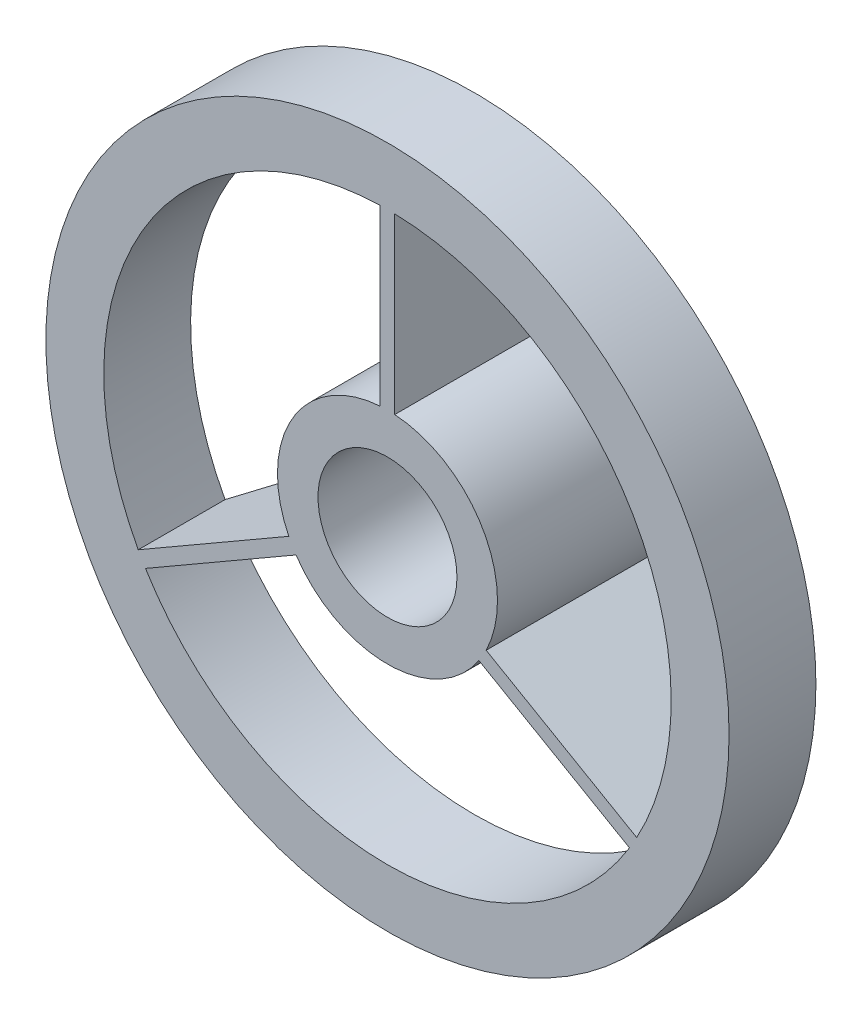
ISO-10303-21;
HEADER;
FILE_DESCRIPTION(('STEP AP214'),'2;1');
FILE_NAME('part.step','',(''),(''),'','','');
FILE_SCHEMA(('AUTOMOTIVE_DESIGN { 1 0 10303 214 1 1 1 1 }'));
ENDSEC;
DATA;
#1=APPLICATION_CONTEXT('core data for automotive mechanical design processes');
#2=APPLICATION_PROTOCOL_DEFINITION('international standard','automotive_design',2000,#1);
#3=PRODUCT_CONTEXT('',#1,'mechanical');
#4=PRODUCT('Part','Part','',(#3));
#5=PRODUCT_RELATED_PRODUCT_CATEGORY('part','',(#4));
#6=PRODUCT_DEFINITION_FORMATION('','',#4);
#7=PRODUCT_DEFINITION_CONTEXT('part definition',#1,'design');
#8=PRODUCT_DEFINITION('design','',#6,#7);
#9=PRODUCT_DEFINITION_SHAPE('','',#8);
#10=(LENGTH_UNIT() NAMED_UNIT(*) SI_UNIT(.MILLI.,.METRE.));
#11=(NAMED_UNIT(*) PLANE_ANGLE_UNIT() SI_UNIT($,.RADIAN.));
#12=(NAMED_UNIT(*) SI_UNIT($,.STERADIAN.) SOLID_ANGLE_UNIT());
#13=UNCERTAINTY_MEASURE_WITH_UNIT(LENGTH_MEASURE(1.E-05),#10,'distance_accuracy_value','');
#14=(GEOMETRIC_REPRESENTATION_CONTEXT(3) GLOBAL_UNCERTAINTY_ASSIGNED_CONTEXT((#13)) GLOBAL_UNIT_ASSIGNED_CONTEXT((#10,
#11,#12)) REPRESENTATION_CONTEXT('',''));
#15=CARTESIAN_POINT('',(0.,0.,0.));
#16=DIRECTION('',(0.,0.,1.));
#17=DIRECTION('',(1.,0.,0.));
#18=AXIS2_PLACEMENT_3D('',#15,#16,#17);
#19=CARTESIAN_POINT('',(0.,0.,3.5));
#20=DIRECTION('',(0.,0.,-1.));
#21=DIRECTION('',(-1.,0.,0.));
#22=AXIS2_PLACEMENT_3D('',#19,#20,#21);
#23=CYLINDRICAL_SURFACE('',#22,1.9);
#24=DIRECTION('',(0.,0.,-1.));
#25=VECTOR('',#24,1.);
#26=CARTESIAN_POINT('',(-1.70438344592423,-0.839688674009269,3.5));
#27=LINE('',#26,#25);
#28=CARTESIAN_POINT('',(-1.70438344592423,-0.83968867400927,3.5));
#29=VERTEX_POINT('',#28);
#30=CARTESIAN_POINT('',(-1.70438344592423,-0.83968867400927,0.));
#31=VERTEX_POINT('',#30);
#32=EDGE_CURVE('E168',#29,#31,#27,.T.);
#33=ORIENTED_EDGE('',*,*,#32,.F.);
#34=CARTESIAN_POINT('',(0.,0.,3.5));
#35=DIRECTION('',(0.,0.,1.));
#36=DIRECTION('',(1.,0.,0.));
#37=AXIS2_PLACEMENT_3D('',#34,#35,#36);
#38=CIRCLE('',#37,1.9);
#39=CARTESIAN_POINT('',(-0.125,1.89588369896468,3.5));
#40=VERTEX_POINT('',#39);
#41=EDGE_CURVE('E289',#40,#29,#38,.T.);
#42=ORIENTED_EDGE('',*,*,#41,.F.);
#43=DIRECTION('',(0.,0.,-1.));
#44=VECTOR('',#43,1.);
#45=CARTESIAN_POINT('',(-0.125,1.89588369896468,3.5));
#46=LINE('',#45,#44);
#47=CARTESIAN_POINT('',(-0.125,1.89588369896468,0.));
#48=VERTEX_POINT('',#47);
#49=EDGE_CURVE('E292',#40,#48,#46,.T.);
#50=ORIENTED_EDGE('',*,*,#49,.T.);
#51=CARTESIAN_POINT('',(0.,0.,0.));
#52=DIRECTION('',(0.,0.,1.));
#53=DIRECTION('',(1.,0.,0.));
#54=AXIS2_PLACEMENT_3D('',#51,#52,#53);
#55=CIRCLE('',#54,1.9);
#56=EDGE_CURVE('E295',#48,#31,#55,.T.);
#57=ORIENTED_EDGE('',*,*,#56,.T.);
#58=EDGE_LOOP('',(#33,#42,#50,#57));
#59=FACE_BOUND('',#58,.T.);
#60=ADVANCED_FACE('F37',(#59),#23,.T.);
#61=CARTESIAN_POINT('',(0.,0.,2.));
#62=DIRECTION('',(0.,0.,1.));
#63=DIRECTION('',(1.,0.,0.));
#64=AXIS2_PLACEMENT_3D('',#61,#62,#63);
#65=PLANE('',#64);
#66=CARTESIAN_POINT('',(0.,0.,2.));
#67=DIRECTION('',(0.,0.,1.));
#68=DIRECTION('',(1.,0.,0.));
#69=AXIS2_PLACEMENT_3D('',#66,#67,#68);
#70=CIRCLE('',#69,5.9);
#71=CARTESIAN_POINT('',(5.9,0.,2.));
#72=VERTEX_POINT('',#71);
#73=EDGE_CURVE('E246',#72,#72,#70,.T.);
#74=ORIENTED_EDGE('',*,*,#73,.F.);
#75=EDGE_LOOP('',(#74));
#76=FACE_BOUND('',#75,.T.);
#77=DIRECTION('',(0.866025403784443,0.499999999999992,0.));
#78=VECTOR('',#77,1.);
#79=CARTESIAN_POINT('',(-0.062499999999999,0.108253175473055,2.));
#80=LINE('',#79,#78);
#81=CARTESIAN_POINT('',(-4.30602447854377,-2.34174682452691,2.));
#82=VERTEX_POINT('',#81);
#83=CARTESIAN_POINT('',(-4.30464347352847,-2.34094950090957,2.));
#84=VERTEX_POINT('',#83);
#85=EDGE_CURVE('E198',#82,#84,#80,.T.);
#86=ORIENTED_EDGE('',*,*,#85,.F.);
#87=DIRECTION('',(0.499999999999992,-0.866025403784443,0.));
#88=VECTOR('',#87,1.);
#89=CARTESIAN_POINT('',(-4.30602447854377,-2.34174682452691,2.));
#90=LINE('',#89,#88);
#91=CARTESIAN_POINT('',(-4.18102447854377,-2.55825317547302,2.));
#92=VERTEX_POINT('',#91);
#93=EDGE_CURVE('E179',#82,#92,#90,.T.);
#94=ORIENTED_EDGE('',*,*,#93,.T.);
#95=DIRECTION('',(0.866025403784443,0.499999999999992,0.));
#96=VECTOR('',#95,1.);
#97=CARTESIAN_POINT('',(0.062499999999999,-0.108253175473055,2.));
#98=LINE('',#97,#96);
#99=CARTESIAN_POINT('',(-4.17964347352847,-2.55745585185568,2.));
#100=VERTEX_POINT('',#99);
#101=EDGE_CURVE('E187',#92,#100,#98,.T.);
#102=ORIENTED_EDGE('',*,*,#101,.T.);
#103=CARTESIAN_POINT('',(0.,0.,2.));
#104=DIRECTION('',(0.,0.,1.));
#105=DIRECTION('',(1.,0.,0.));
#106=AXIS2_PLACEMENT_3D('',#103,#104,#105);
#107=CIRCLE('',#106,4.9);
#108=CARTESIAN_POINT('',(4.17964347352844,-2.55745585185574,2.));
#109=VERTEX_POINT('',#108);
#110=EDGE_CURVE('E240',#100,#109,#107,.T.);
#111=ORIENTED_EDGE('',*,*,#110,.T.);
#112=DIRECTION('',(-0.866025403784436,0.500000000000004,0.));
#113=VECTOR('',#112,1.);
#114=CARTESIAN_POINT('',(-0.0625000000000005,-0.108253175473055,2.));
#115=LINE('',#114,#113);
#116=CARTESIAN_POINT('',(4.18102447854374,-2.55825317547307,2.));
#117=VERTEX_POINT('',#116);
#118=EDGE_CURVE('E229',#117,#109,#115,.T.);
#119=ORIENTED_EDGE('',*,*,#118,.F.);
#120=DIRECTION('',(0.500000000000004,0.866025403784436,0.));
#121=VECTOR('',#120,1.);
#122=CARTESIAN_POINT('',(4.18102447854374,-2.55825317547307,2.));
#123=LINE('',#122,#121);
#124=CARTESIAN_POINT('',(4.30602447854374,-2.34174682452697,2.));
#125=VERTEX_POINT('',#124);
#126=EDGE_CURVE('E211',#117,#125,#123,.T.);
#127=ORIENTED_EDGE('',*,*,#126,.T.);
#128=DIRECTION('',(-0.866025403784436,0.500000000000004,0.));
#129=VECTOR('',#128,1.);
#130=CARTESIAN_POINT('',(0.0625000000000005,0.108253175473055,2.));
#131=LINE('',#130,#129);
#132=CARTESIAN_POINT('',(4.30464347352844,-2.34094950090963,2.));
#133=VERTEX_POINT('',#132);
#134=EDGE_CURVE('E223',#125,#133,#131,.T.);
#135=ORIENTED_EDGE('',*,*,#134,.T.);
#136=CARTESIAN_POINT('',(0.125,4.89840535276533,2.));
#137=VERTEX_POINT('',#136);
#138=EDGE_CURVE('E241',#133,#137,#107,.T.);
#139=ORIENTED_EDGE('',*,*,#138,.T.);
#140=DIRECTION('',(0.,1.,0.));
#141=VECTOR('',#140,1.);
#142=CARTESIAN_POINT('',(0.125,0.,2.));
#143=LINE('',#142,#141);
#144=CARTESIAN_POINT('',(0.125,4.9,2.));
#145=VERTEX_POINT('',#144);
#146=EDGE_CURVE('E257',#137,#145,#143,.T.);
#147=ORIENTED_EDGE('',*,*,#146,.T.);
#148=DIRECTION('',(-1.,0.,0.));
#149=VECTOR('',#148,1.);
#150=CARTESIAN_POINT('',(0.125,4.9,2.));
#151=LINE('',#150,#149);
#152=CARTESIAN_POINT('',(-0.125,4.9,2.));
#153=VERTEX_POINT('',#152);
#154=EDGE_CURVE('E272',#145,#153,#151,.T.);
#155=ORIENTED_EDGE('',*,*,#154,.T.);
#156=DIRECTION('',(0.,1.,0.));
#157=VECTOR('',#156,1.);
#158=CARTESIAN_POINT('',(-0.125,0.,2.));
#159=LINE('',#158,#157);
#160=CARTESIAN_POINT('',(-0.125,4.89840535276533,2.));
#161=VERTEX_POINT('',#160);
#162=EDGE_CURVE('E259',#161,#153,#159,.T.);
#163=ORIENTED_EDGE('',*,*,#162,.F.);
#164=EDGE_CURVE('E236',#161,#84,#107,.T.);
#165=ORIENTED_EDGE('',*,*,#164,.T.);
#166=EDGE_LOOP('',(#86,#94,#102,#111,#119,#127,#135,#139,#147,#155,#163,#165));
#167=FACE_BOUND('',#166,.T.);
#168=ADVANCED_FACE('F342',(#76,#167),#65,.F.);
#169=CARTESIAN_POINT('',(0.,0.,2.));
#170=DIRECTION('',(0.,0.,1.));
#171=DIRECTION('',(1.,0.,0.));
#172=AXIS2_PLACEMENT_3D('',#169,#170,#171);
#173=CYLINDRICAL_SURFACE('',#172,4.9);
#174=DIRECTION('',(0.,0.,1.));
#175=VECTOR('',#174,1.);
#176=CARTESIAN_POINT('',(-4.30464347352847,-2.34094950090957,2.));
#177=LINE('',#176,#175);
#178=CARTESIAN_POINT('',(-4.30464347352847,-2.34094950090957,3.5));
#179=VERTEX_POINT('',#178);
#180=EDGE_CURVE('E196',#84,#179,#177,.T.);
#181=ORIENTED_EDGE('',*,*,#180,.F.);
#182=ORIENTED_EDGE('',*,*,#164,.F.);
#183=DIRECTION('',(0.,0.,1.));
#184=VECTOR('',#183,1.);
#185=CARTESIAN_POINT('',(-0.125,4.89840535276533,2.));
#186=LINE('',#185,#184);
#187=CARTESIAN_POINT('',(-0.125,4.89840535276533,3.5));
#188=VERTEX_POINT('',#187);
#189=EDGE_CURVE('E249',#188,#161,#186,.F.);
#190=ORIENTED_EDGE('',*,*,#189,.F.);
#191=CARTESIAN_POINT('',(0.,0.,3.5));
#192=DIRECTION('',(0.,0.,1.));
#193=DIRECTION('',(1.,0.,0.));
#194=AXIS2_PLACEMENT_3D('',#191,#192,#193);
#195=CIRCLE('',#194,4.9);
#196=EDGE_CURVE('E242',#188,#179,#195,.T.);
#197=ORIENTED_EDGE('',*,*,#196,.T.);
#198=EDGE_LOOP('',(#181,#182,#190,#197));
#199=FACE_BOUND('',#198,.T.);
#200=ADVANCED_FACE('F357',(#199),#173,.F.);
#201=CARTESIAN_POINT('',(-1.57938344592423,-1.05619502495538,3.5));
#202=VERTEX_POINT('',#201);
#203=CARTESIAN_POINT('',(1.57938344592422,-1.0561950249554,3.5));
#204=VERTEX_POINT('',#203);
#205=EDGE_CURVE('E293',#202,#204,#38,.T.);
#206=ORIENTED_EDGE('',*,*,#205,.F.);
#207=DIRECTION('',(0.,0.,-1.));
#208=VECTOR('',#207,1.);
#209=CARTESIAN_POINT('',(-1.57938344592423,-1.05619502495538,3.5));
#210=LINE('',#209,#208);
#211=CARTESIAN_POINT('',(-1.57938344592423,-1.05619502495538,0.));
#212=VERTEX_POINT('',#211);
#213=EDGE_CURVE('E194',#202,#212,#210,.T.);
#214=ORIENTED_EDGE('',*,*,#213,.T.);
#215=CARTESIAN_POINT('',(1.57938344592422,-1.0561950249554,0.));
#216=VERTEX_POINT('',#215);
#217=EDGE_CURVE('E297',#212,#216,#55,.T.);
#218=ORIENTED_EDGE('',*,*,#217,.T.);
#219=DIRECTION('',(0.,0.,-1.));
#220=VECTOR('',#219,1.);
#221=CARTESIAN_POINT('',(1.57938344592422,-1.0561950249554,3.5));
#222=LINE('',#221,#220);
#223=EDGE_CURVE('E232',#204,#216,#222,.T.);
#224=ORIENTED_EDGE('',*,*,#223,.F.);
#225=EDGE_LOOP('',(#206,#214,#218,#224));
#226=FACE_BOUND('',#225,.T.);
#227=ADVANCED_FACE('F334',(#226),#23,.T.);
#228=ORIENTED_EDGE('',*,*,#110,.F.);
#229=DIRECTION('',(0.,0.,1.));
#230=VECTOR('',#229,1.);
#231=CARTESIAN_POINT('',(-4.17964347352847,-2.55745585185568,2.));
#232=LINE('',#231,#230);
#233=CARTESIAN_POINT('',(-4.17964347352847,-2.55745585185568,3.5));
#234=VERTEX_POINT('',#233);
#235=EDGE_CURVE('E185',#100,#234,#232,.T.);
#236=ORIENTED_EDGE('',*,*,#235,.T.);
#237=CARTESIAN_POINT('',(4.17964347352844,-2.55745585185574,3.5));
#238=VERTEX_POINT('',#237);
#239=EDGE_CURVE('E245',#234,#238,#195,.T.);
#240=ORIENTED_EDGE('',*,*,#239,.T.);
#241=DIRECTION('',(0.,0.,1.));
#242=VECTOR('',#241,1.);
#243=CARTESIAN_POINT('',(4.17964347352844,-2.55745585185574,2.));
#244=LINE('',#243,#242);
#245=EDGE_CURVE('E11',#109,#238,#244,.T.);
#246=ORIENTED_EDGE('',*,*,#245,.F.);
#247=EDGE_LOOP('',(#228,#236,#240,#246));
#248=FACE_BOUND('',#247,.T.);
#249=ADVANCED_FACE('F317',(#248),#173,.F.);
#250=CARTESIAN_POINT('',(0.125,0.,0.));
#251=DIRECTION('',(-1.,0.,0.));
#252=DIRECTION('',(0.,0.,1.));
#253=AXIS2_PLACEMENT_3D('',#250,#251,#252);
#254=PLANE('',#253);
#255=ORIENTED_EDGE('',*,*,#146,.F.);
#256=DIRECTION('',(0.,0.,1.));
#257=VECTOR('',#256,1.);
#258=CARTESIAN_POINT('',(0.125,4.89840535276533,2.));
#259=LINE('',#258,#257);
#260=CARTESIAN_POINT('',(0.125,4.89840535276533,3.5));
#261=VERTEX_POINT('',#260);
#262=EDGE_CURVE('E254',#261,#137,#259,.F.);
#263=ORIENTED_EDGE('',*,*,#262,.F.);
#264=DIRECTION('',(0.,-1.,0.));
#265=VECTOR('',#264,1.);
#266=CARTESIAN_POINT('',(0.125,1.9,3.5));
#267=LINE('',#266,#265);
#268=CARTESIAN_POINT('',(0.125,1.89588369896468,3.5));
#269=VERTEX_POINT('',#268);
#270=EDGE_CURVE('E269',#261,#269,#267,.T.);
#271=ORIENTED_EDGE('',*,*,#270,.T.);
#272=DIRECTION('',(0.,0.,-1.));
#273=VECTOR('',#272,1.);
#274=CARTESIAN_POINT('',(0.125,1.89588369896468,3.5));
#275=LINE('',#274,#273);
#276=CARTESIAN_POINT('',(0.125,1.89588369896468,0.));
#277=VERTEX_POINT('',#276);
#278=EDGE_CURVE('E300',#269,#277,#275,.T.);
#279=ORIENTED_EDGE('',*,*,#278,.T.);
#280=DIRECTION('',(0.,1.,0.));
#281=VECTOR('',#280,1.);
#282=CARTESIAN_POINT('',(0.125,1.9,0.));
#283=LINE('',#282,#281);
#284=CARTESIAN_POINT('',(0.125,1.9,0.));
#285=VERTEX_POINT('',#284);
#286=EDGE_CURVE('E263',#277,#285,#283,.T.);
#287=ORIENTED_EDGE('',*,*,#286,.T.);
#288=DIRECTION('',(0.,0.832050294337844,0.554700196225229));
#289=VECTOR('',#288,1.);
#290=CARTESIAN_POINT('',(0.125,4.9,2.));
#291=LINE('',#290,#289);
#292=EDGE_CURVE('E265',#285,#145,#291,.T.);
#293=ORIENTED_EDGE('',*,*,#292,.T.);
#294=EDGE_LOOP('',(#255,#263,#271,#279,#287,#293));
#295=FACE_BOUND('',#294,.T.);
#296=ADVANCED_FACE('F331',(#295),#254,.F.);
#297=CARTESIAN_POINT('',(-0.125,0.,0.));
#298=DIRECTION('',(-1.,0.,0.));
#299=DIRECTION('',(0.,0.,1.));
#300=AXIS2_PLACEMENT_3D('',#297,#298,#299);
#301=PLANE('',#300);
#302=ORIENTED_EDGE('',*,*,#189,.T.);
#303=ORIENTED_EDGE('',*,*,#162,.T.);
#304=DIRECTION('',(0.,0.832050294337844,0.554700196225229));
#305=VECTOR('',#304,1.);
#306=CARTESIAN_POINT('',(-0.125,4.9,2.));
#307=LINE('',#306,#305);
#308=CARTESIAN_POINT('',(-0.125,1.9,0.));
#309=VERTEX_POINT('',#308);
#310=EDGE_CURVE('E275',#309,#153,#307,.T.);
#311=ORIENTED_EDGE('',*,*,#310,.F.);
#312=DIRECTION('',(0.,1.,0.));
#313=VECTOR('',#312,1.);
#314=CARTESIAN_POINT('',(-0.125,1.9,0.));
#315=LINE('',#314,#313);
#316=EDGE_CURVE('E262',#48,#309,#315,.T.);
#317=ORIENTED_EDGE('',*,*,#316,.F.);
#318=ORIENTED_EDGE('',*,*,#49,.F.);
#319=DIRECTION('',(0.,-1.,0.));
#320=VECTOR('',#319,1.);
#321=CARTESIAN_POINT('',(-0.125,1.9,3.5));
#322=LINE('',#321,#320);
#323=EDGE_CURVE('E266',#188,#40,#322,.T.);
#324=ORIENTED_EDGE('',*,*,#323,.F.);
#325=EDGE_LOOP('',(#302,#303,#311,#317,#318,#324));
#326=FACE_BOUND('',#325,.T.);
#327=ADVANCED_FACE('F351',(#326),#301,.T.);
#328=CARTESIAN_POINT('',(1.70438344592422,-0.839688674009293,3.5));
#329=VERTEX_POINT('',#328);
#330=EDGE_CURVE('E294',#329,#269,#38,.T.);
#331=ORIENTED_EDGE('',*,*,#330,.F.);
#332=DIRECTION('',(0.,0.,-1.));
#333=VECTOR('',#332,1.);
#334=CARTESIAN_POINT('',(1.70438344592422,-0.839688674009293,3.5));
#335=LINE('',#334,#333);
#336=CARTESIAN_POINT('',(1.70438344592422,-0.839688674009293,0.));
#337=VERTEX_POINT('',#336);
#338=EDGE_CURVE('E226',#329,#337,#335,.T.);
#339=ORIENTED_EDGE('',*,*,#338,.T.);
#340=EDGE_CURVE('E286',#337,#277,#55,.T.);
#341=ORIENTED_EDGE('',*,*,#340,.T.);
#342=ORIENTED_EDGE('',*,*,#278,.F.);
#343=EDGE_LOOP('',(#331,#339,#341,#342));
#344=FACE_BOUND('',#343,.T.);
#345=ADVANCED_FACE('F39',(#344),#23,.T.);
#346=CARTESIAN_POINT('',(0.,0.,3.5));
#347=DIRECTION('',(0.,0.,1.));
#348=DIRECTION('',(1.,0.,0.));
#349=AXIS2_PLACEMENT_3D('',#346,#347,#348);
#350=PLANE('',#349);
#351=DIRECTION('',(0.866025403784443,0.499999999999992,0.));
#352=VECTOR('',#351,1.);
#353=CARTESIAN_POINT('',(-1.58294826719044,-1.05825317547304,3.5));
#354=LINE('',#353,#352);
#355=EDGE_CURVE('E52',#234,#202,#354,.T.);
#356=ORIENTED_EDGE('',*,*,#355,.T.);
#357=ORIENTED_EDGE('',*,*,#205,.T.);
#358=DIRECTION('',(-0.866025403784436,0.500000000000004,0.));
#359=VECTOR('',#358,1.);
#360=CARTESIAN_POINT('',(1.58294826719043,-1.05825317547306,3.5));
#361=LINE('',#360,#359);
#362=EDGE_CURVE('E208',#238,#204,#361,.T.);
#363=ORIENTED_EDGE('',*,*,#362,.F.);
#364=ORIENTED_EDGE('',*,*,#239,.F.);
#365=EDGE_LOOP('',(#356,#357,#363,#364));
#366=FACE_BOUND('',#365,.T.);
#367=ORIENTED_EDGE('',*,*,#41,.T.);
#368=DIRECTION('',(0.866025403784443,0.499999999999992,0.));
#369=VECTOR('',#368,1.);
#370=CARTESIAN_POINT('',(-1.70794826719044,-0.841746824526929,3.5));
#371=LINE('',#370,#369);
#372=EDGE_CURVE('E180',#179,#29,#371,.T.);
#373=ORIENTED_EDGE('',*,*,#372,.F.);
#374=ORIENTED_EDGE('',*,*,#196,.F.);
#375=ORIENTED_EDGE('',*,*,#323,.T.);
#376=EDGE_LOOP('',(#367,#373,#374,#375));
#377=FACE_BOUND('',#376,.T.);
#378=CARTESIAN_POINT('',(0.,0.,3.5));
#379=DIRECTION('',(0.,0.,1.));
#380=DIRECTION('',(1.,0.,0.));
#381=AXIS2_PLACEMENT_3D('',#378,#379,#380);
#382=CIRCLE('',#381,5.9);
#383=CARTESIAN_POINT('',(5.9,0.,3.5));
#384=VERTEX_POINT('',#383);
#385=EDGE_CURVE('E239',#384,#384,#382,.T.);
#386=ORIENTED_EDGE('',*,*,#385,.T.);
#387=EDGE_LOOP('',(#386));
#388=FACE_BOUND('',#387,.T.);
#389=CARTESIAN_POINT('',(0.,0.,3.5));
#390=DIRECTION('',(0.,0.,1.));
#391=DIRECTION('',(1.,0.,0.));
#392=AXIS2_PLACEMENT_3D('',#389,#390,#391);
#393=CIRCLE('',#392,1.2);
#394=CARTESIAN_POINT('',(1.2,0.,3.5));
#395=VERTEX_POINT('',#394);
#396=EDGE_CURVE('E283',#395,#395,#393,.T.);
#397=ORIENTED_EDGE('',*,*,#396,.F.);
#398=EDGE_LOOP('',(#397));
#399=FACE_BOUND('',#398,.T.);
#400=DIRECTION('',(-0.866025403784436,0.500000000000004,0.));
#401=VECTOR('',#400,1.);
#402=CARTESIAN_POINT('',(1.70794826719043,-0.841746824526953,3.5));
#403=LINE('',#402,#401);
#404=CARTESIAN_POINT('',(4.30464347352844,-2.34094950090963,3.5));
#405=VERTEX_POINT('',#404);
#406=EDGE_CURVE('E205',#405,#329,#403,.T.);
#407=ORIENTED_EDGE('',*,*,#406,.T.);
#408=ORIENTED_EDGE('',*,*,#330,.T.);
#409=ORIENTED_EDGE('',*,*,#270,.F.);
#410=EDGE_CURVE('E235',#405,#261,#195,.T.);
#411=ORIENTED_EDGE('',*,*,#410,.F.);
#412=EDGE_LOOP('',(#407,#408,#409,#411));
#413=FACE_BOUND('',#412,.T.);
#414=ADVANCED_FACE('F311',(#366,#377,#388,#399,#413),#350,.T.);
#415=CARTESIAN_POINT('',(0.,0.,0.));
#416=DIRECTION('',(0.,0.,1.));
#417=DIRECTION('',(1.,0.,0.));
#418=AXIS2_PLACEMENT_3D('',#415,#416,#417);
#419=PLANE('',#418);
#420=DIRECTION('',(-0.866025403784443,-0.499999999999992,0.));
#421=VECTOR('',#420,1.);
#422=CARTESIAN_POINT('',(-1.58294826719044,-1.05825317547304,0.));
#423=LINE('',#422,#421);
#424=CARTESIAN_POINT('',(-1.58294826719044,-1.05825317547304,0.));
#425=VERTEX_POINT('',#424);
#426=EDGE_CURVE('E58',#212,#425,#423,.T.);
#427=ORIENTED_EDGE('',*,*,#426,.T.);
#428=DIRECTION('',(0.499999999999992,-0.866025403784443,0.));
#429=VECTOR('',#428,1.);
#430=CARTESIAN_POINT('',(-1.70794826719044,-0.841746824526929,0.));
#431=LINE('',#430,#429);
#432=CARTESIAN_POINT('',(-1.70794826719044,-0.841746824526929,0.));
#433=VERTEX_POINT('',#432);
#434=EDGE_CURVE('E177',#433,#425,#431,.T.);
#435=ORIENTED_EDGE('',*,*,#434,.F.);
#436=DIRECTION('',(-0.866025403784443,-0.499999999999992,0.));
#437=VECTOR('',#436,1.);
#438=CARTESIAN_POINT('',(-1.70794826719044,-0.841746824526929,0.));
#439=LINE('',#438,#437);
#440=EDGE_CURVE('E162',#31,#433,#439,.T.);
#441=ORIENTED_EDGE('',*,*,#440,.F.);
#442=ORIENTED_EDGE('',*,*,#56,.F.);
#443=ORIENTED_EDGE('',*,*,#316,.T.);
#444=DIRECTION('',(-1.,0.,0.));
#445=VECTOR('',#444,1.);
#446=CARTESIAN_POINT('',(0.125,1.9,0.));
#447=LINE('',#446,#445);
#448=EDGE_CURVE('E280',#285,#309,#447,.T.);
#449=ORIENTED_EDGE('',*,*,#448,.F.);
#450=ORIENTED_EDGE('',*,*,#286,.F.);
#451=ORIENTED_EDGE('',*,*,#340,.F.);
#452=DIRECTION('',(0.866025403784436,-0.500000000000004,0.));
#453=VECTOR('',#452,1.);
#454=CARTESIAN_POINT('',(1.70794826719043,-0.841746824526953,0.));
#455=LINE('',#454,#453);
#456=CARTESIAN_POINT('',(1.70794826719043,-0.841746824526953,0.));
#457=VERTEX_POINT('',#456);
#458=EDGE_CURVE('E201',#337,#457,#455,.T.);
#459=ORIENTED_EDGE('',*,*,#458,.T.);
#460=DIRECTION('',(0.500000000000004,0.866025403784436,0.));
#461=VECTOR('',#460,1.);
#462=CARTESIAN_POINT('',(1.58294826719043,-1.05825317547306,0.));
#463=LINE('',#462,#461);
#464=CARTESIAN_POINT('',(1.58294826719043,-1.05825317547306,0.));
#465=VERTEX_POINT('',#464);
#466=EDGE_CURVE('E221',#465,#457,#463,.T.);
#467=ORIENTED_EDGE('',*,*,#466,.F.);
#468=DIRECTION('',(0.866025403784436,-0.500000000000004,0.));
#469=VECTOR('',#468,1.);
#470=CARTESIAN_POINT('',(1.58294826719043,-1.05825317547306,0.));
#471=LINE('',#470,#469);
#472=EDGE_CURVE('E202',#216,#465,#471,.T.);
#473=ORIENTED_EDGE('',*,*,#472,.F.);
#474=ORIENTED_EDGE('',*,*,#217,.F.);
#475=EDGE_LOOP('',(#427,#435,#441,#442,#443,#449,#450,#451,#459,#467,#473,#474));
#476=FACE_BOUND('',#475,.T.);
#477=CARTESIAN_POINT('',(0.,0.,0.));
#478=DIRECTION('',(0.,0.,1.));
#479=DIRECTION('',(1.,0.,0.));
#480=AXIS2_PLACEMENT_3D('',#477,#478,#479);
#481=CIRCLE('',#480,1.2);
#482=CARTESIAN_POINT('',(1.2,0.,0.));
#483=VERTEX_POINT('',#482);
#484=EDGE_CURVE('E282',#483,#483,#481,.T.);
#485=ORIENTED_EDGE('',*,*,#484,.T.);
#486=EDGE_LOOP('',(#485));
#487=FACE_BOUND('',#486,.T.);
#488=ADVANCED_FACE('F182',(#476,#487),#419,.F.);
#489=CARTESIAN_POINT('',(0.,0.,3.5));
#490=DIRECTION('',(0.,0.,-1.));
#491=DIRECTION('',(-1.,0.,0.));
#492=AXIS2_PLACEMENT_3D('',#489,#490,#491);
#493=CYLINDRICAL_SURFACE('',#492,1.2);
#494=ORIENTED_EDGE('',*,*,#396,.T.);
#495=EDGE_LOOP('',(#494));
#496=FACE_BOUND('',#495,.T.);
#497=ORIENTED_EDGE('',*,*,#484,.F.);
#498=EDGE_LOOP('',(#497));
#499=FACE_BOUND('',#498,.T.);
#500=ADVANCED_FACE('F397',(#496,#499),#493,.F.);
#501=CARTESIAN_POINT('',(0.125,4.9,2.));
#502=DIRECTION('',(0.,-0.554700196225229,0.832050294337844));
#503=DIRECTION('',(0.,-0.832050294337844,-0.554700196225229));
#504=AXIS2_PLACEMENT_3D('',#501,#502,#503);
#505=PLANE('',#504);
#506=ORIENTED_EDGE('',*,*,#310,.T.);
#507=ORIENTED_EDGE('',*,*,#154,.F.);
#508=ORIENTED_EDGE('',*,*,#292,.F.);
#509=ORIENTED_EDGE('',*,*,#448,.T.);
#510=EDGE_LOOP('',(#506,#507,#508,#509));
#511=FACE_BOUND('',#510,.T.);
#512=ADVANCED_FACE('F347',(#511),#505,.F.);
#513=ORIENTED_EDGE('',*,*,#138,.F.);
#514=DIRECTION('',(0.,0.,1.));
#515=VECTOR('',#514,1.);
#516=CARTESIAN_POINT('',(4.30464347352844,-2.34094950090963,2.));
#517=LINE('',#516,#515);
#518=EDGE_CURVE('E45',#133,#405,#517,.T.);
#519=ORIENTED_EDGE('',*,*,#518,.T.);
#520=ORIENTED_EDGE('',*,*,#410,.T.);
#521=ORIENTED_EDGE('',*,*,#262,.T.);
#522=EDGE_LOOP('',(#513,#519,#520,#521));
#523=FACE_BOUND('',#522,.T.);
#524=ADVANCED_FACE('F306',(#523),#173,.F.);
#525=CARTESIAN_POINT('',(0.,0.,2.));
#526=DIRECTION('',(0.,0.,1.));
#527=DIRECTION('',(1.,0.,0.));
#528=AXIS2_PLACEMENT_3D('',#525,#526,#527);
#529=CYLINDRICAL_SURFACE('',#528,5.9);
#530=ORIENTED_EDGE('',*,*,#73,.T.);
#531=EDGE_LOOP('',(#530));
#532=FACE_BOUND('',#531,.T.);
#533=ORIENTED_EDGE('',*,*,#385,.F.);
#534=EDGE_LOOP('',(#533));
#535=FACE_BOUND('',#534,.T.);
#536=ADVANCED_FACE('F421',(#532,#535),#529,.T.);
#537=CARTESIAN_POINT('',(-0.0625000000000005,-0.108253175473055,0.));
#538=DIRECTION('',(0.500000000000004,0.866025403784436,0.));
#539=DIRECTION('',(0.,0.,1.));
#540=AXIS2_PLACEMENT_3D('',#537,#538,#539);
#541=PLANE('',#540);
#542=ORIENTED_EDGE('',*,*,#362,.T.);
#543=ORIENTED_EDGE('',*,*,#223,.T.);
#544=ORIENTED_EDGE('',*,*,#472,.T.);
#545=DIRECTION('',(0.72057669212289,-0.416025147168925,0.554700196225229));
#546=VECTOR('',#545,1.);
#547=CARTESIAN_POINT('',(4.18102447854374,-2.55825317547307,2.));
#548=LINE('',#547,#546);
#549=EDGE_CURVE('E204',#465,#117,#548,.T.);
#550=ORIENTED_EDGE('',*,*,#549,.T.);
#551=ORIENTED_EDGE('',*,*,#118,.T.);
#552=ORIENTED_EDGE('',*,*,#245,.T.);
#553=EDGE_LOOP('',(#542,#543,#544,#550,#551,#552));
#554=FACE_BOUND('',#553,.T.);
#555=ADVANCED_FACE('F321',(#554),#541,.F.);
#556=CARTESIAN_POINT('',(0.0625000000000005,0.108253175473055,0.));
#557=DIRECTION('',(0.500000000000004,0.866025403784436,0.));
#558=DIRECTION('',(0.,0.,1.));
#559=AXIS2_PLACEMENT_3D('',#556,#557,#558);
#560=PLANE('',#559);
#561=ORIENTED_EDGE('',*,*,#338,.F.);
#562=ORIENTED_EDGE('',*,*,#406,.F.);
#563=ORIENTED_EDGE('',*,*,#518,.F.);
#564=ORIENTED_EDGE('',*,*,#134,.F.);
#565=DIRECTION('',(0.72057669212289,-0.416025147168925,0.554700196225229));
#566=VECTOR('',#565,1.);
#567=CARTESIAN_POINT('',(4.30602447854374,-2.34174682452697,2.));
#568=LINE('',#567,#566);
#569=EDGE_CURVE('E214',#457,#125,#568,.T.);
#570=ORIENTED_EDGE('',*,*,#569,.F.);
#571=ORIENTED_EDGE('',*,*,#458,.F.);
#572=EDGE_LOOP('',(#561,#562,#563,#564,#570,#571));
#573=FACE_BOUND('',#572,.T.);
#574=ADVANCED_FACE('F433',(#573),#560,.T.);
#575=CARTESIAN_POINT('',(4.18102447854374,-2.55825317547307,2.));
#576=DIRECTION('',(-0.48038446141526,0.277350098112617,0.832050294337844));
#577=DIRECTION('',(0.866025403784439,0.,0.499999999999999));
#578=AXIS2_PLACEMENT_3D('',#575,#576,#577);
#579=PLANE('',#578);
#580=ORIENTED_EDGE('',*,*,#569,.T.);
#581=ORIENTED_EDGE('',*,*,#126,.F.);
#582=ORIENTED_EDGE('',*,*,#549,.F.);
#583=ORIENTED_EDGE('',*,*,#466,.T.);
#584=EDGE_LOOP('',(#580,#581,#582,#583));
#585=FACE_BOUND('',#584,.T.);
#586=ADVANCED_FACE('F340',(#585),#579,.F.);
#587=CARTESIAN_POINT('',(-0.062499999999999,0.108253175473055,0.));
#588=DIRECTION('',(0.499999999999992,-0.866025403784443,0.));
#589=DIRECTION('',(0.,0.,1.));
#590=AXIS2_PLACEMENT_3D('',#587,#588,#589);
#591=PLANE('',#590);
#592=ORIENTED_EDGE('',*,*,#372,.T.);
#593=ORIENTED_EDGE('',*,*,#32,.T.);
#594=ORIENTED_EDGE('',*,*,#440,.T.);
#595=DIRECTION('',(-0.720576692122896,-0.416025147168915,0.554700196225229));
#596=VECTOR('',#595,1.);
#597=CARTESIAN_POINT('',(-4.30602447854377,-2.34174682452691,2.));
#598=LINE('',#597,#596);
#599=EDGE_CURVE('E165',#433,#82,#598,.T.);
#600=ORIENTED_EDGE('',*,*,#599,.T.);
#601=ORIENTED_EDGE('',*,*,#85,.T.);
#602=ORIENTED_EDGE('',*,*,#180,.T.);
#603=EDGE_LOOP('',(#592,#593,#594,#600,#601,#602));
#604=FACE_BOUND('',#603,.T.);
#605=ADVANCED_FACE('F164',(#604),#591,.F.);
#606=CARTESIAN_POINT('',(0.062499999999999,-0.108253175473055,0.));
#607=DIRECTION('',(0.499999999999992,-0.866025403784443,0.));
#608=DIRECTION('',(0.,0.,1.));
#609=AXIS2_PLACEMENT_3D('',#606,#607,#608);
#610=PLANE('',#609);
#611=ORIENTED_EDGE('',*,*,#213,.F.);
#612=ORIENTED_EDGE('',*,*,#355,.F.);
#613=ORIENTED_EDGE('',*,*,#235,.F.);
#614=ORIENTED_EDGE('',*,*,#101,.F.);
#615=DIRECTION('',(-0.720576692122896,-0.416025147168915,0.554700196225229));
#616=VECTOR('',#615,1.);
#617=CARTESIAN_POINT('',(-4.18102447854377,-2.55825317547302,2.));
#618=LINE('',#617,#616);
#619=EDGE_CURVE('E364',#425,#92,#618,.T.);
#620=ORIENTED_EDGE('',*,*,#619,.F.);
#621=ORIENTED_EDGE('',*,*,#426,.F.);
#622=EDGE_LOOP('',(#611,#612,#613,#614,#620,#621));
#623=FACE_BOUND('',#622,.T.);
#624=ADVANCED_FACE('F365',(#623),#610,.T.);
#625=CARTESIAN_POINT('',(-4.30602447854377,-2.34174682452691,2.));
#626=DIRECTION('',(0.480384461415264,0.27735009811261,0.832050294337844));
#627=DIRECTION('',(0.866025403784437,0.,-0.500000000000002));
#628=AXIS2_PLACEMENT_3D('',#625,#626,#627);
#629=PLANE('',#628);
#630=ORIENTED_EDGE('',*,*,#619,.T.);
#631=ORIENTED_EDGE('',*,*,#93,.F.);
#632=ORIENTED_EDGE('',*,*,#599,.F.);
#633=ORIENTED_EDGE('',*,*,#434,.T.);
#634=EDGE_LOOP('',(#630,#631,#632,#633));
#635=FACE_BOUND('',#634,.T.);
#636=ADVANCED_FACE('F176',(#635),#629,.F.);
#637=CLOSED_SHELL('',(#60,#168,#200,#227,#249,#296,#327,#345,#414,#488,#500,#512,#524,#536,#555,
#574,#586,#605,#624,#636));
#638=MANIFOLD_SOLID_BREP('B2',#637);
#639=ADVANCED_BREP_SHAPE_REPRESENTATION('',(#18,#638),#14);
#640=SHAPE_DEFINITION_REPRESENTATION(#9,#639);
ENDSEC;
END-ISO-10303-21;
